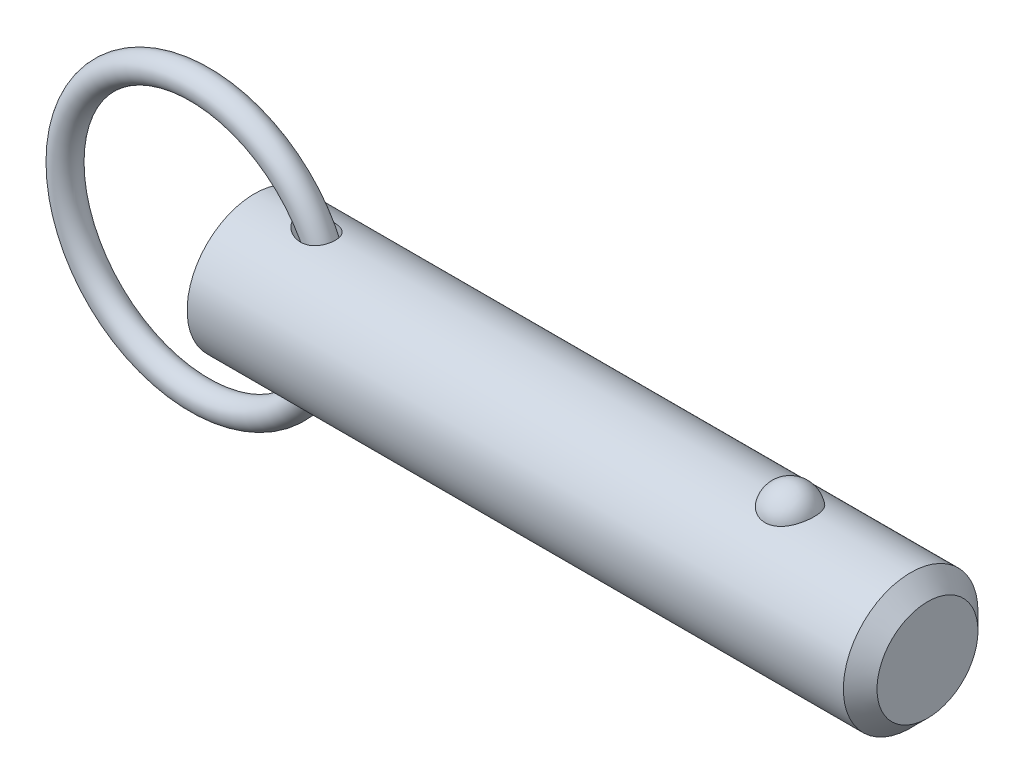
ISO-10303-21;
HEADER;
FILE_DESCRIPTION(('STEP AP214'),'2;1');
FILE_NAME('part.step','',(''),(''),'','','');
FILE_SCHEMA(('AUTOMOTIVE_DESIGN { 1 0 10303 214 1 1 1 1 }'));
ENDSEC;
DATA;
#1=APPLICATION_CONTEXT('core data for automotive mechanical design processes');
#2=APPLICATION_PROTOCOL_DEFINITION('international standard','automotive_design',2000,#1);
#3=PRODUCT_CONTEXT('',#1,'mechanical');
#4=PRODUCT('Part','Part','',(#3));
#5=PRODUCT_RELATED_PRODUCT_CATEGORY('part','',(#4));
#6=PRODUCT_DEFINITION_FORMATION('','',#4);
#7=PRODUCT_DEFINITION_CONTEXT('part definition',#1,'design');
#8=PRODUCT_DEFINITION('design','',#6,#7);
#9=PRODUCT_DEFINITION_SHAPE('','',#8);
#10=(LENGTH_UNIT() NAMED_UNIT(*) SI_UNIT(.MILLI.,.METRE.));
#11=(NAMED_UNIT(*) PLANE_ANGLE_UNIT() SI_UNIT($,.RADIAN.));
#12=(NAMED_UNIT(*) SI_UNIT($,.STERADIAN.) SOLID_ANGLE_UNIT());
#13=UNCERTAINTY_MEASURE_WITH_UNIT(LENGTH_MEASURE(1.E-05),#10,'distance_accuracy_value','');
#14=(GEOMETRIC_REPRESENTATION_CONTEXT(3) GLOBAL_UNCERTAINTY_ASSIGNED_CONTEXT((#13)) GLOBAL_UNIT_ASSIGNED_CONTEXT((#10,
#11,#12)) REPRESENTATION_CONTEXT('',''));
#15=CARTESIAN_POINT('',(0.,0.,0.));
#16=DIRECTION('',(0.,0.,1.));
#17=DIRECTION('',(1.,0.,0.));
#18=AXIS2_PLACEMENT_3D('',#15,#16,#17);
#19=CARTESIAN_POINT('',(-6.46799987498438,0.,0.));
#20=DIRECTION('',(0.,0.,1.));
#21=DIRECTION('',(1.,0.,0.));
#22=AXIS2_PLACEMENT_3D('',#19,#20,#21);
#23=TOROIDAL_SURFACE('',#22,15.875,1.588);
#24=CARTESIAN_POINT('',(10.9950001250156,0.,0.));
#25=VERTEX_POINT('',#24);
#26=VERTEX_LOOP('',#25);
#27=FACE_BOUND('',#26,.T.);
#28=ADVANCED_FACE('P0_F12',(#27),#23,.T.);
#29=CLOSED_SHELL('',(#28));
#30=MANIFOLD_SOLID_BREP('P0_B1',#29);
#31=CARTESIAN_POINT('',(0.,0.,0.));
#32=DIRECTION('',(1.,0.,0.));
#33=DIRECTION('',(0.,0.,-1.));
#34=AXIS2_PLACEMENT_3D('',#31,#32,#33);
#35=CYLINDRICAL_SURFACE('',#34,7.94);
#36=CARTESIAN_POINT('',(5.37881269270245,7.8641200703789,-1.0950869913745));
#37=CARTESIAN_POINT('',(5.49078530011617,7.84653010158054,-1.22142628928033));
#38=CARTESIAN_POINT('',(5.61742164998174,7.82766483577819,-1.33478448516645));
#39=CARTESIAN_POINT('',(5.82155225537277,7.80005811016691,-1.48501770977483));
#40=CARTESIAN_POINT('',(5.89211597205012,7.79095331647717,-1.53186949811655));
#41=CARTESIAN_POINT('',(6.03726296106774,7.77331484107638,-1.61899652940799));
#42=CARTESIAN_POINT('',(6.11184478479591,7.76478095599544,-1.65927412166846));
#43=CARTESIAN_POINT('',(6.31831542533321,7.74290334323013,-1.75933205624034));
#44=CARTESIAN_POINT('',(6.45343253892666,7.73042593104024,-1.81276183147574));
#45=CARTESIAN_POINT('',(6.73017339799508,7.70966096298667,-1.89912673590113));
#46=CARTESIAN_POINT('',(6.8717909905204,7.70136953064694,-1.93208083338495));
#47=CARTESIAN_POINT('',(7.17522096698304,7.6896684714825,-1.97820987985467));
#48=CARTESIAN_POINT('',(7.33750100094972,7.68691980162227,-1.98871513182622));
#49=CARTESIAN_POINT('',(7.5799424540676,7.68880305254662,-1.98137951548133));
#50=CARTESIAN_POINT('',(7.66059155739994,7.69043175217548,-1.97508575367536));
#51=CARTESIAN_POINT('',(7.82077465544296,7.69570110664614,-1.95445819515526));
#52=CARTESIAN_POINT('',(7.90030910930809,7.69934090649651,-1.94012781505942));
#53=CARTESIAN_POINT('',(8.09280087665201,7.71066069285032,-1.89475688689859));
#54=CARTESIAN_POINT('',(8.20465204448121,7.71942251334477,-1.85909462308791));
#55=CARTESIAN_POINT('',(8.42059371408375,7.74035594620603,-1.7699066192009));
#56=CARTESIAN_POINT('',(8.52468939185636,7.75252525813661,-1.7163929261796));
#57=CARTESIAN_POINT('',(8.72211003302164,7.77903750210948,-1.59192358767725));
#58=CARTESIAN_POINT('',(8.81539818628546,7.79338749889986,-1.52091076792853));
#59=CARTESIAN_POINT('',(8.98759177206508,7.8225086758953,-1.36321590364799));
#60=CARTESIAN_POINT('',(9.06649712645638,7.83727985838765,-1.27653377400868));
#61=CARTESIAN_POINT('',(9.20311499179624,7.86453692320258,-1.09567667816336));
#62=CARTESIAN_POINT('',(9.26180839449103,7.8771064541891,-1.00225329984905));
#63=CARTESIAN_POINT('',(9.36257622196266,7.89954213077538,-0.806547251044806));
#64=CARTESIAN_POINT('',(9.40465301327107,7.9094086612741,-0.704265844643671));
#65=CARTESIAN_POINT('',(9.47062404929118,7.92520709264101,-0.495461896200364));
#66=CARTESIAN_POINT('',(9.4947881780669,7.9311972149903,-0.38902885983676));
#67=CARTESIAN_POINT('',(9.52544004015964,7.93883641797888,-0.17349446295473));
#68=CARTESIAN_POINT('',(9.53192786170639,7.94048552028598,-0.0643931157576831));
#69=CARTESIAN_POINT('',(9.52707996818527,7.93926454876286,0.153487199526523));
#70=CARTESIAN_POINT('',(9.51572796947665,7.93639034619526,0.262265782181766));
#71=CARTESIAN_POINT('',(9.47542322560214,7.92642470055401,0.47631311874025));
#72=CARTESIAN_POINT('',(9.44647056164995,7.91933327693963,0.581581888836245));
#73=CARTESIAN_POINT('',(9.3716401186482,7.90170355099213,0.785602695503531));
#74=CARTESIAN_POINT('',(9.32576415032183,7.89116561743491,0.884355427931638));
#75=CARTESIAN_POINT('',(9.21823065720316,7.8677977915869,1.07254831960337));
#76=CARTESIAN_POINT('',(9.15657431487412,7.85496807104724,1.16198917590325));
#77=CARTESIAN_POINT('',(9.01919194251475,7.82843688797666,1.32903649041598));
#78=CARTESIAN_POINT('',(8.94347744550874,7.81473614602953,1.40665255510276));
#79=CARTESIAN_POINT('',(8.78012086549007,7.7879321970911,1.5481977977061));
#80=CARTESIAN_POINT('',(8.69247914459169,7.77482897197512,1.61212739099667));
#81=CARTESIAN_POINT('',(8.50642314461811,7.75037063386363,1.72592270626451));
#82=CARTESIAN_POINT('',(8.40786430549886,7.73904540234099,1.77555777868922));
#83=CARTESIAN_POINT('',(8.2039870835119,7.71943979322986,1.85894844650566));
#84=CARTESIAN_POINT('',(8.0986670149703,7.7111601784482,1.89270006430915));
#85=CARTESIAN_POINT('',(7.87703213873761,7.69782475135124,1.94625652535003));
#86=CARTESIAN_POINT('',(7.76044899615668,7.69301557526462,1.96500324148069));
#87=CARTESIAN_POINT('',(7.52574256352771,7.68770484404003,1.98567257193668));
#88=CARTESIAN_POINT('',(7.40761868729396,7.68720497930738,1.98758858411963));
#89=CARTESIAN_POINT('',(7.15639592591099,7.69044495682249,1.97502233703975));
#90=CARTESIAN_POINT('',(7.02341871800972,7.69476380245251,1.9583009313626));
#91=CARTESIAN_POINT('',(6.76125891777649,7.70776394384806,1.90648094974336));
#92=CARTESIAN_POINT('',(6.6320804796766,7.71644984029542,1.87136299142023));
#93=CARTESIAN_POINT('',(6.35978215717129,7.73875442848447,1.77707737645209));
#94=CARTESIAN_POINT('',(6.2177212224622,7.75293863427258,1.71496895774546));
#95=CARTESIAN_POINT('',(5.94559201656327,7.78383102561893,1.56880760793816));
#96=CARTESIAN_POINT('',(5.81552062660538,7.80053855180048,1.48476040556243));
#97=CARTESIAN_POINT('',(5.60081087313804,7.83035955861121,1.31701356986));
#98=CARTESIAN_POINT('',(5.51265224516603,7.84340226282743,1.23780647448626));
#99=CARTESIAN_POINT('',(5.34976240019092,7.86852524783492,1.06647953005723));
#100=CARTESIAN_POINT('',(5.27500719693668,7.88060722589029,0.974383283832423));
#101=CARTESIAN_POINT('',(5.15877594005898,7.89990441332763,0.800548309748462));
#102=CARTESIAN_POINT('',(5.11360209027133,7.90759876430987,0.721348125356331));
#103=CARTESIAN_POINT('',(5.03655060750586,7.92090267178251,0.556518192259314));
#104=CARTESIAN_POINT('',(5.00466157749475,7.92651401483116,0.470894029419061));
#105=CARTESIAN_POINT('',(4.95653766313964,7.93503671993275,0.294356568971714));
#106=CARTESIAN_POINT('',(4.94043621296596,7.93792505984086,0.203404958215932));
#107=CARTESIAN_POINT('',(4.92605720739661,7.94050250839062,0.0200631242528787));
#108=CARTESIAN_POINT('',(4.92776929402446,7.9401934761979,-0.0723262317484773));
#109=CARTESIAN_POINT('',(4.94742735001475,7.93667454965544,-0.243250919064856));
#110=CARTESIAN_POINT('',(4.96327131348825,7.93384031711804,-0.322048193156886));
#111=CARTESIAN_POINT('',(5.00707570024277,7.92609115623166,-0.476058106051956));
#112=CARTESIAN_POINT('',(5.03503965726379,7.92117562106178,-0.55126969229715));
#113=CARTESIAN_POINT('',(5.10737112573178,7.90866290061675,-0.709995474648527));
#114=CARTESIAN_POINT('',(5.15379379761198,7.90074105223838,-0.792541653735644));
#115=CARTESIAN_POINT('',(5.2582083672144,7.88338732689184,-0.949781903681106));
#116=CARTESIAN_POINT('',(5.31621941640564,7.87395295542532,-1.02446265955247));
#117=CARTESIAN_POINT('',(5.37881269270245,7.8641200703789,-1.0950869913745));
#118=B_SPLINE_CURVE_WITH_KNOTS('',3,(#36,#37,#38,#39,#40,#41,#42,#43,#44,#45,#46,#47,#48,#49,
#50,#51,#52,#53,#54,#55,#56,#57,#58,#59,#60,#61,#62,#63,#64,#65,#66,#67,#68,#69,#70,#71,#72,#73,
#74,#75,#76,#77,#78,#79,#80,#81,#82,#83,#84,#85,#86,#87,#88,#89,#90,#91,#92,#93,#94,#95,#96,#97,
#98,#99,#100,#101,#102,#103,#104,#105,#106,#107,#108,#109,#110,#111,#112,#113,#114,#115,#116,
#117),.UNSPECIFIED.,.T.,.F.,(4,2,2,2,2,2,2,2,2,2,2,2,2,2,2,2,2,2,2,2,2,2,2,2,2,2,2,2,2,2,2,2,2,
2,2,2,2,2,2,2,4),(0.,0.508599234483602,0.763935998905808,1.01918131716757,1.45492798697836,
1.89027038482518,2.37502798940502,2.61739702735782,2.8596631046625,3.21120678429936,
3.56251370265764,3.91498401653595,4.26745624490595,4.59897839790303,4.93045331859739,
5.25682643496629,5.58319792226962,5.909867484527,6.23653553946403,6.56316865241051,
6.88977729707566,7.21611917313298,7.54245114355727,7.87378632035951,8.20520442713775,
8.55832700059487,8.91158808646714,9.31234018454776,9.71351536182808,10.1786231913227,
10.6436096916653,11.0001264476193,11.3559986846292,11.6294791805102,11.9027245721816,
12.1782599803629,12.4536351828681,12.693828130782,12.9340911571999,13.2179277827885,
13.5022374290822),.UNSPECIFIED.);
#119=CARTESIAN_POINT('',(5.37881269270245,7.8641200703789,-1.0950869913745));
#120=VERTEX_POINT('',#119);
#121=EDGE_CURVE('P1_E40',#120,#120,#118,.T.);
#122=ORIENTED_EDGE('',*,*,#121,.T.);
#123=EDGE_LOOP('',(#122));
#124=FACE_BOUND('',#123,.T.);
#125=CARTESIAN_POINT('',(77.395,0.,0.));
#126=DIRECTION('',(1.,0.,0.));
#127=DIRECTION('',(0.,0.,-1.));
#128=AXIS2_PLACEMENT_3D('',#125,#126,#127);
#129=CIRCLE('',#128,7.94);
#130=CARTESIAN_POINT('',(77.395,0.,-7.94));
#131=VERTEX_POINT('',#130);
#132=EDGE_CURVE('P1_E25',#131,#131,#129,.T.);
#133=ORIENTED_EDGE('',*,*,#132,.F.);
#134=EDGE_LOOP('',(#133));
#135=FACE_BOUND('',#134,.T.);
#136=CARTESIAN_POINT('',(0.,0.,0.));
#137=DIRECTION('',(1.,0.,0.));
#138=DIRECTION('',(0.,0.,-1.));
#139=AXIS2_PLACEMENT_3D('',#136,#137,#138);
#140=CIRCLE('',#139,7.94);
#141=CARTESIAN_POINT('',(0.,0.,-7.94));
#142=VERTEX_POINT('',#141);
#143=EDGE_CURVE('P1_E9',#142,#142,#140,.T.);
#144=ORIENTED_EDGE('',*,*,#143,.T.);
#145=EDGE_LOOP('',(#144));
#146=FACE_BOUND('',#145,.T.);
#147=CARTESIAN_POINT('',(63.1649074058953,7.37767842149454,2.93486986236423));
#148=CARTESIAN_POINT('',(63.0127496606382,7.3776732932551,2.93487505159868));
#149=CARTESIAN_POINT('',(62.8606329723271,7.38258419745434,2.92262454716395));
#150=CARTESIAN_POINT('',(62.5609284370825,7.40163229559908,2.87404196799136));
#151=CARTESIAN_POINT('',(62.4133394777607,7.41576720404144,2.83771585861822));
#152=CARTESIAN_POINT('',(62.1270187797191,7.45161576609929,2.74218769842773));
#153=CARTESIAN_POINT('',(61.9882745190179,7.47331841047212,2.68301886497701));
#154=CARTESIAN_POINT('',(61.7228822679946,7.52194082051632,2.54350967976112));
#155=CARTESIAN_POINT('',(61.5962366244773,7.54886159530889,2.46316523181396));
#156=CARTESIAN_POINT('',(61.3545349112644,7.60594671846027,2.28090375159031));
#157=CARTESIAN_POINT('',(61.2399065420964,7.63618114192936,2.17844211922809));
#158=CARTESIAN_POINT('',(61.0288787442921,7.69614046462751,1.95608495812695));
#159=CARTESIAN_POINT('',(60.9324826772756,7.72586526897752,1.83618622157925));
#160=CARTESIAN_POINT('',(60.7559381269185,7.78314821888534,1.57628086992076));
#161=CARTESIAN_POINT('',(60.6767072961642,7.81055035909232,1.43561546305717));
#162=CARTESIAN_POINT('',(60.5417979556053,7.85879631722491,1.14236334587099));
#163=CARTESIAN_POINT('',(60.4861216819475,7.87963951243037,0.989775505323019));
#164=CARTESIAN_POINT('',(60.3988121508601,7.91289645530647,0.674619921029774));
#165=CARTESIAN_POINT('',(60.3675309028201,7.92518652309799,0.511941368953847));
#166=CARTESIAN_POINT('',(60.330975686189,7.93958930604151,0.183247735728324));
#167=CARTESIAN_POINT('',(60.3257012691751,7.94170219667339,0.0172327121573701));
#168=CARTESIAN_POINT('',(60.3412311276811,7.93554931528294,-0.312672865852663));
#169=CARTESIAN_POINT('',(60.3619253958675,7.92732732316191,-0.476569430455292));
#170=CARTESIAN_POINT('',(60.4287865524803,7.90141534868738,-0.798305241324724));
#171=CARTESIAN_POINT('',(60.4749539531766,7.88372517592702,-0.956144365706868));
#172=CARTESIAN_POINT('',(60.5918986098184,7.84066230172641,-1.2615207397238));
#173=CARTESIAN_POINT('',(60.6627046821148,7.81528060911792,-1.40904568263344));
#174=CARTESIAN_POINT('',(60.8274789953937,7.7594867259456,-1.68950598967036));
#175=CARTESIAN_POINT('',(60.9214488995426,7.72907417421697,-1.82244030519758));
#176=CARTESIAN_POINT('',(61.1308391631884,7.66640424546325,-2.07032792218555));
#177=CARTESIAN_POINT('',(61.2463152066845,7.63414223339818,-2.1852330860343));
#178=CARTESIAN_POINT('',(61.4959006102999,7.57149681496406,-2.39329737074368));
#179=CARTESIAN_POINT('',(61.6300080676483,7.54111321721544,-2.48645870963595));
#180=CARTESIAN_POINT('',(61.9101113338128,7.48650742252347,-2.64628132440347));
#181=CARTESIAN_POINT('',(62.0557605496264,7.46215900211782,-2.71350554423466));
#182=CARTESIAN_POINT('',(62.3574259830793,7.42171253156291,-2.82226614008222));
#183=CARTESIAN_POINT('',(62.5134383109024,7.40561140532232,-2.86381209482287));
#184=CARTESIAN_POINT('',(62.8229708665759,7.3842679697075,-2.9183907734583));
#185=CARTESIAN_POINT('',(62.9762229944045,7.37852109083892,-2.93275024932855));
#186=CARTESIAN_POINT('',(63.2830705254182,7.37700973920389,-2.93655208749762));
#187=CARTESIAN_POINT('',(63.4366658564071,7.38124333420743,-2.92599927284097));
#188=CARTESIAN_POINT('',(63.7349907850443,7.39890635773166,-2.88102897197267));
#189=CARTESIAN_POINT('',(63.8798480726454,7.41205491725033,-2.8473399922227));
#190=CARTESIAN_POINT('',(64.1616432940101,7.445801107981,-2.7578820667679));
#191=CARTESIAN_POINT('',(64.2985805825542,7.46639934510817,-2.70211132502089));
#192=CARTESIAN_POINT('',(64.5640619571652,7.51339098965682,-2.56858908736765));
#193=CARTESIAN_POINT('',(64.6923548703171,7.53990200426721,-2.4903806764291));
#194=CARTESIAN_POINT('',(64.9342440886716,7.59569503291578,-2.31462737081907));
#195=CARTESIAN_POINT('',(65.0478370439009,7.6249776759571,-2.21707808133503));
#196=CARTESIAN_POINT('',(65.26322156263,7.68489473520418,-1.99982049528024));
#197=CARTESIAN_POINT('',(65.3641488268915,7.71552419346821,-1.87925337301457));
#198=CARTESIAN_POINT('',(65.5451866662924,7.77353016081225,-1.62268826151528));
#199=CARTESIAN_POINT('',(65.6252934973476,7.80090608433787,-1.48668750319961));
#200=CARTESIAN_POINT('',(65.7653615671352,7.85047992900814,-1.19818413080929));
#201=CARTESIAN_POINT('',(65.8245877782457,7.8724818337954,-1.04529016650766));
#202=CARTESIAN_POINT('',(65.9179821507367,7.90785114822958,-0.731080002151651));
#203=CARTESIAN_POINT('',(65.9521497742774,7.92121837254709,-0.569763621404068));
#204=CARTESIAN_POINT('',(65.994795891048,7.93797834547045,-0.242812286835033));
#205=CARTESIAN_POINT('',(66.0032047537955,7.94134405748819,-0.0771668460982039));
#206=CARTESIAN_POINT('',(65.9939626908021,7.93767937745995,0.253276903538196));
#207=CARTESIAN_POINT('',(65.9763120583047,7.93064910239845,0.418075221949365));
#208=CARTESIAN_POINT('',(65.9154247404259,7.90695571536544,0.741525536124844));
#209=CARTESIAN_POINT('',(65.8722819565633,7.8903279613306,0.900197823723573));
#210=CARTESIAN_POINT('',(65.7613535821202,7.84916386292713,1.20759654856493));
#211=CARTESIAN_POINT('',(65.69356656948,7.82462706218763,1.35632241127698));
#212=CARTESIAN_POINT('',(65.5343718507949,7.7700669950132,1.64032869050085));
#213=CARTESIAN_POINT('',(65.4428616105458,7.7400200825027,1.7755471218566));
#214=CARTESIAN_POINT('',(65.2382960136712,7.67774175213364,2.02800648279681));
#215=CARTESIAN_POINT('',(65.1252410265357,7.64551037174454,2.14524772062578));
#216=CARTESIAN_POINT('',(64.8808318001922,7.58265895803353,2.35778002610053));
#217=CARTESIAN_POINT('',(64.7495833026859,7.55203092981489,2.45319004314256));
#218=CARTESIAN_POINT('',(64.471601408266,7.49579792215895,2.61999897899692));
#219=CARTESIAN_POINT('',(64.3248670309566,7.47019326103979,2.69139637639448));
#220=CARTESIAN_POINT('',(64.0129477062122,7.42622216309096,2.8105324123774));
#221=CARTESIAN_POINT('',(63.8472209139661,7.40825002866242,2.85700910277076));
#222=CARTESIAN_POINT('',(63.5092792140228,7.38398348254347,2.9191685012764));
#223=CARTESIAN_POINT('',(63.3370670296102,7.3776842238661,2.93486399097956));
#224=CARTESIAN_POINT('',(63.1649074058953,7.37767842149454,2.93486986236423));
#225=B_SPLINE_CURVE_WITH_KNOTS('',3,(#147,#148,#149,#150,#151,#152,#153,#154,#155,#156,#157,
#158,#159,#160,#161,#162,#163,#164,#165,#166,#167,#168,#169,#170,#171,#172,#173,#174,#175,#176,
#177,#178,#179,#180,#181,#182,#183,#184,#185,#186,#187,#188,#189,#190,#191,#192,#193,#194,#195,
#196,#197,#198,#199,#200,#201,#202,#203,#204,#205,#206,#207,#208,#209,#210,#211,#212,#213,#214,
#215,#216,#217,#218,#219,#220,#221,#222,#223,#224),.UNSPECIFIED.,.T.,.F.,(4,2,2,2,2,2,2,2,2,2,2,
2,2,2,2,2,2,2,2,2,2,2,2,2,2,2,2,2,2,2,2,2,2,2,2,2,2,2,4),(0.,0.455841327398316,
0.911569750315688,1.36663794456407,1.8217942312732,2.28978983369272,2.75787163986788,
3.24685368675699,3.73588214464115,4.23184282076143,4.72779494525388,5.22165321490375,
5.71552141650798,6.20996917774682,6.70445245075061,7.20023431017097,7.69596557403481,
8.18023418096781,8.66432203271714,9.12410697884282,9.58380291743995,10.0296503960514,
10.4755341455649,10.9312349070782,11.3870393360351,11.8654416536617,12.3439299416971,
12.8378875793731,13.3318558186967,13.8271581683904,14.3224549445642,14.8159385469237,
15.3094506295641,15.8051323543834,16.3008055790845,16.7937101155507,17.2866458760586,
17.8026240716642,18.3183879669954),.UNSPECIFIED.);
#226=CARTESIAN_POINT('',(63.1649074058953,7.37767842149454,2.93486986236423));
#227=VERTEX_POINT('',#226);
#228=EDGE_CURVE('P1_E34',#227,#227,#225,.T.);
#229=ORIENTED_EDGE('',*,*,#228,.T.);
#230=EDGE_LOOP('',(#229));
#231=FACE_BOUND('',#230,.T.);
#232=CARTESIAN_POINT('',(5.37881269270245,-7.8641200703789,-1.0950869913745));
#233=CARTESIAN_POINT('',(5.31532711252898,-7.87409326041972,-1.02345575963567));
#234=CARTESIAN_POINT('',(5.25654962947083,-7.88365715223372,-0.947641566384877));
#235=CARTESIAN_POINT('',(5.15093536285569,-7.90122221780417,-0.787865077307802));
#236=CARTESIAN_POINT('',(5.10408931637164,-7.90922460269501,-0.703909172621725));
#237=CARTESIAN_POINT('',(5.02499142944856,-7.92292057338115,-0.5279916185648));
#238=CARTESIAN_POINT('',(4.99290048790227,-7.92858863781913,-0.435954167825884));
#239=CARTESIAN_POINT('',(4.94718343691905,-7.93670712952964,-0.247266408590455));
#240=CARTESIAN_POINT('',(4.93353142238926,-7.93916207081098,-0.150622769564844));
#241=CARTESIAN_POINT('',(4.92669426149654,-7.94038957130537,0.0306459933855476));
#242=CARTESIAN_POINT('',(4.9310562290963,-7.93960347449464,0.115182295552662));
#243=CARTESIAN_POINT('',(4.95441758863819,-7.93542535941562,0.2821331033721));
#244=CARTESIAN_POINT('',(4.97342060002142,-7.93203269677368,0.364547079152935));
#245=CARTESIAN_POINT('',(5.02337664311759,-7.92322764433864,0.521528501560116));
#246=CARTESIAN_POINT('',(5.05377582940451,-7.91790920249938,0.596281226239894));
#247=CARTESIAN_POINT('',(5.1246872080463,-7.90571364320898,0.740640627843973));
#248=CARTESIAN_POINT('',(5.16520358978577,-7.89883588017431,0.810245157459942));
#249=CARTESIAN_POINT('',(5.27792634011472,-7.88012470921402,0.97862022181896));
#250=CARTESIAN_POINT('',(5.35563200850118,-7.86757912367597,1.07363778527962));
#251=CARTESIAN_POINT('',(5.52523836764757,-7.84150676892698,1.24994147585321));
#252=CARTESIAN_POINT('',(5.61717506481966,-7.82797755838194,1.33119164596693));
#253=CARTESIAN_POINT('',(5.83913717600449,-7.79742756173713,1.50104748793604));
#254=CARTESIAN_POINT('',(5.9725742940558,-7.78050347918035,1.58521567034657));
#255=CARTESIAN_POINT('',(6.25160600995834,-7.74942135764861,1.73078109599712));
#256=CARTESIAN_POINT('',(6.39720857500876,-7.73526515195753,1.79216327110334));
#257=CARTESIAN_POINT('',(6.69793322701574,-7.7116170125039,1.89134478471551));
#258=CARTESIAN_POINT('',(6.85312134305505,-7.70216275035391,1.92895428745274));
#259=CARTESIAN_POINT('',(7.16781951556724,-7.68988337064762,1.97736316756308));
#260=CARTESIAN_POINT('',(7.32732244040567,-7.68704791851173,1.98820434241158));
#261=CARTESIAN_POINT('',(7.61290770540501,-7.68890797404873,1.98097687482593));
#262=CARTESIAN_POINT('',(7.73913797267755,-7.69217875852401,1.96837928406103));
#263=CARTESIAN_POINT('',(7.98774248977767,-7.70364253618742,1.92303262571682));
#264=CARTESIAN_POINT('',(8.11011880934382,-7.71183283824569,1.89029457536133));
#265=CARTESIAN_POINT('',(8.34766306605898,-7.73253074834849,1.80375920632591));
#266=CARTESIAN_POINT('',(8.46278682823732,-7.74506226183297,1.74984505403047));
#267=CARTESIAN_POINT('',(8.6806268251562,-7.77294147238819,1.62149891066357));
#268=CARTESIAN_POINT('',(8.78334736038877,-7.78828818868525,1.54707406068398));
#269=CARTESIAN_POINT('',(8.96275951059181,-7.81808719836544,1.38814746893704));
#270=CARTESIAN_POINT('',(9.0410292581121,-7.83247448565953,1.30540890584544));
#271=CARTESIAN_POINT('',(9.18176824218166,-7.86008608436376,1.1272733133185));
#272=CARTESIAN_POINT('',(9.24424163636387,-7.87331070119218,1.03187962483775));
#273=CARTESIAN_POINT('',(9.34924815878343,-7.89649032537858,0.83568428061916));
#274=CARTESIAN_POINT('',(9.39252490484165,-7.90656172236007,0.735293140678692));
#275=CARTESIAN_POINT('',(9.46188913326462,-7.92307290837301,0.528458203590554));
#276=CARTESIAN_POINT('',(9.48797767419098,-7.92951292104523,0.422014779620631));
#277=CARTESIAN_POINT('',(9.5222867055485,-7.93804067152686,0.206589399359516));
#278=CARTESIAN_POINT('',(9.53058328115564,-7.94014694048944,0.0976202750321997));
#279=CARTESIAN_POINT('',(9.52935292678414,-7.93983698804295,-0.120212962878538));
#280=CARTESIAN_POINT('',(9.51982577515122,-7.93742071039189,-0.229077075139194));
#281=CARTESIAN_POINT('',(9.48313466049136,-7.92831916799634,-0.443751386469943));
#282=CARTESIAN_POINT('',(9.45594838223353,-7.92162850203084,-0.549557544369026));
#283=CARTESIAN_POINT('',(9.38454658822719,-7.90469917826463,-0.754954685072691));
#284=CARTESIAN_POINT('',(9.34033171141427,-7.89446065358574,-0.854545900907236));
#285=CARTESIAN_POINT('',(9.23602927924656,-7.87157146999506,-1.04456732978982));
#286=CARTESIAN_POINT('',(9.17596171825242,-7.85892385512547,-1.13500888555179));
#287=CARTESIAN_POINT('',(9.0415343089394,-7.83259746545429,-1.30436780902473));
#288=CARTESIAN_POINT('',(8.96717562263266,-7.81891877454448,-1.38328611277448));
#289=CARTESIAN_POINT('',(8.80603455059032,-7.79196869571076,-1.52782923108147));
#290=CARTESIAN_POINT('',(8.71921490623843,-7.77869867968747,-1.59341269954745));
#291=CARTESIAN_POINT('',(8.53589430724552,-7.7539823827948,-1.7096493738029));
#292=CARTESIAN_POINT('',(8.43939269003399,-7.74253622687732,-1.76030155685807));
#293=CARTESIAN_POINT('',(8.23614706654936,-7.72219212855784,-1.84754820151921));
#294=CARTESIAN_POINT('',(8.12916866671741,-7.71339202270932,-1.88361685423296));
#295=CARTESIAN_POINT('',(7.91082287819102,-7.69955300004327,-1.93940887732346));
#296=CARTESIAN_POINT('',(7.79945379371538,-7.69451555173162,-1.95912586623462));
#297=CARTESIAN_POINT('',(7.56409927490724,-7.6881073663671,-1.98413612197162));
#298=CARTESIAN_POINT('',(7.43993744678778,-7.68713944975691,-1.98784574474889));
#299=CARTESIAN_POINT('',(7.19239878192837,-7.68969629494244,-1.97792309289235));
#300=CARTESIAN_POINT('',(7.0690222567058,-7.69322274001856,-1.96428432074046));
#301=CARTESIAN_POINT('',(6.80624991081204,-7.70498367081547,-1.91768089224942));
#302=CARTESIAN_POINT('',(6.667361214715,-7.71386737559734,-1.88203087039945));
#303=CARTESIAN_POINT('',(6.39625444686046,-7.73551250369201,-1.79098714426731));
#304=CARTESIAN_POINT('',(6.26404857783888,-7.74828074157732,-1.73555871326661));
#305=CARTESIAN_POINT('',(6.06559048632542,-7.77003865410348,-1.63446133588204));
#306=CARTESIAN_POINT('',(5.99591479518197,-7.77821880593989,-1.59522999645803));
#307=CARTESIAN_POINT('',(5.86025875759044,-7.79503524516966,-1.51091846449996));
#308=CARTESIAN_POINT('',(5.79427944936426,-7.8036716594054,-1.46583664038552));
#309=CARTESIAN_POINT('',(5.60322733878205,-7.82978128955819,-1.3219827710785));
#310=CARTESIAN_POINT('',(5.48449649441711,-7.84751780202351,-1.21433077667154));
#311=CARTESIAN_POINT('',(5.37881269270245,-7.8641200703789,-1.0950869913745));
#312=B_SPLINE_CURVE_WITH_KNOTS('',3,(#232,#233,#234,#235,#236,#237,#238,#239,#240,#241,#242,
#243,#244,#245,#246,#247,#248,#249,#250,#251,#252,#253,#254,#255,#256,#257,#258,#259,#260,#261,
#262,#263,#264,#265,#266,#267,#268,#269,#270,#271,#272,#273,#274,#275,#276,#277,#278,#279,#280,
#281,#282,#283,#284,#285,#286,#287,#288,#289,#290,#291,#292,#293,#294,#295,#296,#297,#298,#299,
#300,#301,#302,#303,#304,#305,#306,#307,#308,#309,#310,#311),.UNSPECIFIED.,.T.,.F.,(4,2,2,2,2,2,
2,2,2,2,2,2,2,2,2,2,2,2,2,2,2,2,2,2,2,2,2,2,2,2,2,2,2,2,2,2,2,2,2,4),(0.,0.288363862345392,
0.576503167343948,0.867714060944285,1.15851540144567,1.41111828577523,1.66378363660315,
1.90549406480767,2.1473047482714,2.51540453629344,2.88445136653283,3.35805159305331,
3.83196445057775,4.30961543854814,4.78652012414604,5.16565662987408,5.54458592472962,
5.92563591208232,6.30655339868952,6.64920782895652,6.99177197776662,7.31956587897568,
7.64733959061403,7.97370879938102,8.30008206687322,8.62686856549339,8.95364280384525,
9.28000684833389,9.60634436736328,9.93367879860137,10.261035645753,10.59932199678,
10.9377403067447,11.308967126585,11.6803330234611,12.1096921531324,12.5398088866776,
12.7806650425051,13.0215885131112,13.5016249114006),.UNSPECIFIED.);
#313=CARTESIAN_POINT('',(5.37881269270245,-7.8641200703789,-1.0950869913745));
#314=VERTEX_POINT('',#313);
#315=EDGE_CURVE('P1_E17',#314,#314,#312,.T.);
#316=ORIENTED_EDGE('',*,*,#315,.T.);
#317=EDGE_LOOP('',(#316));
#318=FACE_BOUND('',#317,.T.);
#319=ADVANCED_FACE('P1_F13',(#124,#135,#146,#231,#318),#35,.T.);
#320=CARTESIAN_POINT('',(0.,0.,0.));
#321=DIRECTION('',(-1.,0.,0.));
#322=DIRECTION('',(0.,0.,1.));
#323=AXIS2_PLACEMENT_3D('',#320,#321,#322);
#324=PLANE('',#323);
#325=ORIENTED_EDGE('',*,*,#143,.F.);
#326=EDGE_LOOP('',(#325));
#327=FACE_BOUND('',#326,.T.);
#328=ADVANCED_FACE('P1_F15',(#327),#324,.T.);
#329=CARTESIAN_POINT('',(79.38,0.,0.));
#330=DIRECTION('',(-1.,0.,0.));
#331=DIRECTION('',(0.,0.,1.));
#332=AXIS2_PLACEMENT_3D('',#329,#330,#331);
#333=CONICAL_SURFACE('',#332,5.95500000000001,0.785398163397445);
#334=ORIENTED_EDGE('',*,*,#132,.T.);
#335=EDGE_LOOP('',(#334));
#336=FACE_BOUND('',#335,.T.);
#337=CARTESIAN_POINT('',(79.38,0.,0.));
#338=DIRECTION('',(1.,0.,0.));
#339=DIRECTION('',(0.,0.,-1.));
#340=AXIS2_PLACEMENT_3D('',#337,#338,#339);
#341=CIRCLE('',#340,5.95500000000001);
#342=CARTESIAN_POINT('',(79.38,0.,-5.95500000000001));
#343=VERTEX_POINT('',#342);
#344=EDGE_CURVE('P1_E30',#343,#343,#341,.T.);
#345=ORIENTED_EDGE('',*,*,#344,.F.);
#346=EDGE_LOOP('',(#345));
#347=FACE_BOUND('',#346,.T.);
#348=ADVANCED_FACE('P1_F55',(#336,#347),#333,.T.);
#349=CARTESIAN_POINT('',(79.38,5.95500000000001,0.));
#350=DIRECTION('',(1.,0.,0.));
#351=DIRECTION('',(0.,0.,-1.));
#352=AXIS2_PLACEMENT_3D('',#349,#350,#351);
#353=PLANE('',#352);
#354=ORIENTED_EDGE('',*,*,#344,.T.);
#355=EDGE_LOOP('',(#354));
#356=FACE_BOUND('',#355,.T.);
#357=ADVANCED_FACE('P1_F51',(#356),#353,.T.);
#358=CARTESIAN_POINT('',(63.1649074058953,7.14599999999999,0.));
#359=DIRECTION('',(-1.,0.,0.));
#360=DIRECTION('',(0.,1.,0.));
#361=AXIS2_PLACEMENT_3D('',#358,#359,#360);
#362=SPHERICAL_SURFACE('',#361,2.944);
#363=ORIENTED_EDGE('',*,*,#228,.F.);
#364=EDGE_LOOP('',(#363));
#365=FACE_BOUND('',#364,.T.);
#366=ADVANCED_FACE('P1_F46',(#365),#362,.T.);
#367=CARTESIAN_POINT('',(-6.46799987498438,0.,0.));
#368=DIRECTION('',(0.,0.,1.));
#369=DIRECTION('',(1.,0.,0.));
#370=AXIS2_PLACEMENT_3D('',#367,#368,#369);
#371=TOROIDAL_SURFACE('',#370,15.875,1.985);
#372=ORIENTED_EDGE('',*,*,#315,.F.);
#373=EDGE_LOOP('',(#372));
#374=FACE_BOUND('',#373,.T.);
#375=ORIENTED_EDGE('',*,*,#121,.F.);
#376=EDGE_LOOP('',(#375));
#377=FACE_BOUND('',#376,.T.);
#378=ADVANCED_FACE('P1_F50',(#374,#377),#371,.F.);
#379=CLOSED_SHELL('',(#319,#328,#348,#357,#366,#378));
#380=MANIFOLD_SOLID_BREP('P1_B1',#379);
#381=ADVANCED_BREP_SHAPE_REPRESENTATION('',(#18,#30,#380),#14);
#382=SHAPE_DEFINITION_REPRESENTATION(#9,#381);
ENDSEC;
END-ISO-10303-21;
